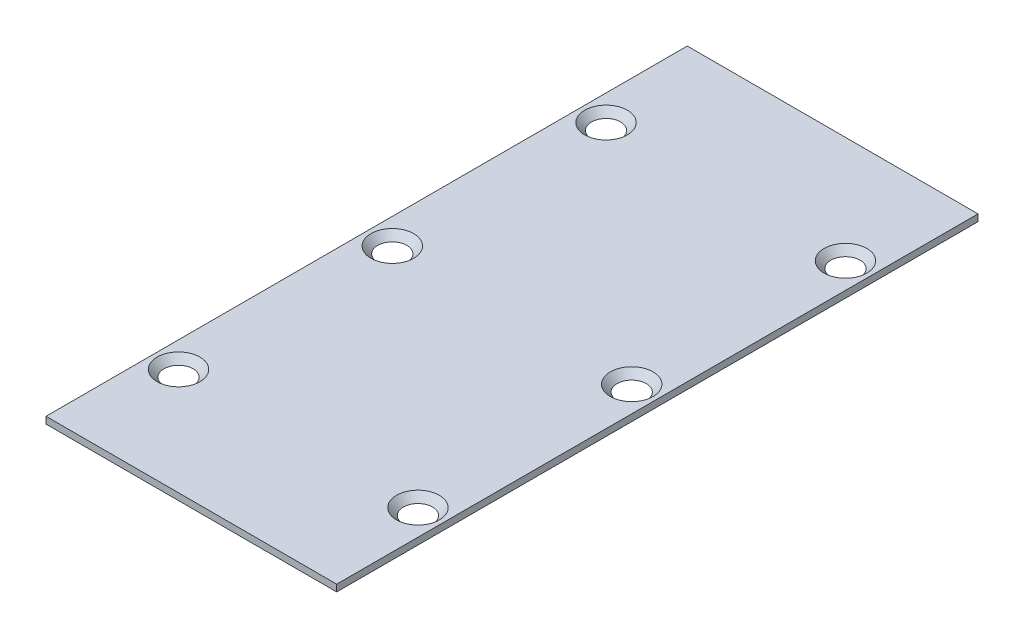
ISO-10303-21;
HEADER;
FILE_DESCRIPTION(('STEP AP214'),'2;1');
FILE_NAME('part.step','',(''),(''),'','','');
FILE_SCHEMA(('AUTOMOTIVE_DESIGN { 1 0 10303 214 1 1 1 1 }'));
ENDSEC;
DATA;
#1=APPLICATION_CONTEXT('core data for automotive mechanical design processes');
#2=APPLICATION_PROTOCOL_DEFINITION('international standard','automotive_design',2000,#1);
#3=PRODUCT_CONTEXT('',#1,'mechanical');
#4=PRODUCT('Part','Part','',(#3));
#5=PRODUCT_RELATED_PRODUCT_CATEGORY('part','',(#4));
#6=PRODUCT_DEFINITION_FORMATION('','',#4);
#7=PRODUCT_DEFINITION_CONTEXT('part definition',#1,'design');
#8=PRODUCT_DEFINITION('design','',#6,#7);
#9=PRODUCT_DEFINITION_SHAPE('','',#8);
#10=(LENGTH_UNIT() NAMED_UNIT(*) SI_UNIT(.MILLI.,.METRE.));
#11=(NAMED_UNIT(*) PLANE_ANGLE_UNIT() SI_UNIT($,.RADIAN.));
#12=(NAMED_UNIT(*) SI_UNIT($,.STERADIAN.) SOLID_ANGLE_UNIT());
#13=UNCERTAINTY_MEASURE_WITH_UNIT(LENGTH_MEASURE(1.E-05),#10,'distance_accuracy_value','');
#14=(GEOMETRIC_REPRESENTATION_CONTEXT(3) GLOBAL_UNCERTAINTY_ASSIGNED_CONTEXT((#13)) GLOBAL_UNIT_ASSIGNED_CONTEXT((#10,
#11,#12)) REPRESENTATION_CONTEXT('',''));
#15=CARTESIAN_POINT('',(0.,0.,0.));
#16=DIRECTION('',(0.,0.,1.));
#17=DIRECTION('',(1.,0.,0.));
#18=AXIS2_PLACEMENT_3D('',#15,#16,#17);
#19=CARTESIAN_POINT('',(0.,0.793749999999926,0.));
#20=DIRECTION('',(0.,1.,0.));
#21=DIRECTION('',(0.,0.,1.));
#22=AXIS2_PLACEMENT_3D('',#19,#20,#21);
#23=PLANE('',#22);
#24=DIRECTION('',(0.,0.,1.));
#25=VECTOR('',#24,1.);
#26=CARTESIAN_POINT('',(34.,0.793749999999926,-75.));
#27=LINE('',#26,#25);
#28=CARTESIAN_POINT('',(34.,0.793749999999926,75.));
#29=VERTEX_POINT('',#28);
#30=CARTESIAN_POINT('',(34.,0.793749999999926,-75.));
#31=VERTEX_POINT('',#30);
#32=EDGE_CURVE('E56',#29,#31,#27,.F.);
#33=ORIENTED_EDGE('',*,*,#32,.T.);
#34=DIRECTION('',(1.,0.,0.));
#35=VECTOR('',#34,1.);
#36=CARTESIAN_POINT('',(-34.,0.793749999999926,-75.));
#37=LINE('',#36,#35);
#38=CARTESIAN_POINT('',(-34.,0.793749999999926,-75.));
#39=VERTEX_POINT('',#38);
#40=EDGE_CURVE('E254',#31,#39,#37,.F.);
#41=ORIENTED_EDGE('',*,*,#40,.T.);
#42=DIRECTION('',(0.,0.,-1.));
#43=VECTOR('',#42,1.);
#44=CARTESIAN_POINT('',(-34.,0.793749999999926,-75.));
#45=LINE('',#44,#43);
#46=CARTESIAN_POINT('',(-34.,0.793749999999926,75.));
#47=VERTEX_POINT('',#46);
#48=EDGE_CURVE('E61',#39,#47,#45,.F.);
#49=ORIENTED_EDGE('',*,*,#48,.T.);
#50=DIRECTION('',(-1.,0.,0.));
#51=VECTOR('',#50,1.);
#52=CARTESIAN_POINT('',(-34.,0.793749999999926,75.));
#53=LINE('',#52,#51);
#54=EDGE_CURVE('E59',#47,#29,#53,.F.);
#55=ORIENTED_EDGE('',*,*,#54,.T.);
#56=EDGE_LOOP('',(#33,#41,#49,#55));
#57=FACE_BOUND('',#56,.T.);
#58=CARTESIAN_POINT('',(28.,0.793750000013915,50.));
#59=DIRECTION('',(0.,1.,0.));
#60=DIRECTION('',(0.,0.,1.));
#61=AXIS2_PLACEMENT_3D('',#58,#59,#60);
#62=CIRCLE('',#61,4.99999999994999);
#63=CARTESIAN_POINT('',(28.,0.793750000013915,54.99999999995));
#64=VERTEX_POINT('',#63);
#65=EDGE_CURVE('E103',#64,#64,#62,.F.);
#66=ORIENTED_EDGE('',*,*,#65,.T.);
#67=EDGE_LOOP('',(#66));
#68=FACE_BOUND('',#67,.T.);
#69=CARTESIAN_POINT('',(28.,0.793750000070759,-50.));
#70=DIRECTION('',(0.,1.,0.));
#71=DIRECTION('',(-1.,0.,0.));
#72=AXIS2_PLACEMENT_3D('',#69,#70,#71);
#73=CIRCLE('',#72,4.99999999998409);
#74=CARTESIAN_POINT('',(23.0000000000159,0.793750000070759,-50.));
#75=VERTEX_POINT('',#74);
#76=EDGE_CURVE('E67',#75,#75,#73,.F.);
#77=ORIENTED_EDGE('',*,*,#76,.T.);
#78=EDGE_LOOP('',(#77));
#79=FACE_BOUND('',#78,.T.);
#80=CARTESIAN_POINT('',(28.,0.793750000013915,0.));
#81=DIRECTION('',(0.,1.,0.));
#82=DIRECTION('',(0.,0.,1.));
#83=AXIS2_PLACEMENT_3D('',#80,#81,#82);
#84=CIRCLE('',#83,4.99999999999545);
#85=CARTESIAN_POINT('',(28.,0.793750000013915,4.99999999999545));
#86=VERTEX_POINT('',#85);
#87=EDGE_CURVE('E100',#86,#86,#84,.F.);
#88=ORIENTED_EDGE('',*,*,#87,.T.);
#89=EDGE_LOOP('',(#88));
#90=FACE_BOUND('',#89,.T.);
#91=CARTESIAN_POINT('',(-28.,0.793750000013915,50.));
#92=DIRECTION('',(0.,1.,0.));
#93=DIRECTION('',(-1.,0.,0.));
#94=AXIS2_PLACEMENT_3D('',#91,#92,#93);
#95=CIRCLE('',#94,4.99999999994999);
#96=CARTESIAN_POINT('',(-32.99999999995,0.793750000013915,50.));
#97=VERTEX_POINT('',#96);
#98=EDGE_CURVE('E108',#97,#97,#95,.F.);
#99=ORIENTED_EDGE('',*,*,#98,.T.);
#100=EDGE_LOOP('',(#99));
#101=FACE_BOUND('',#100,.T.);
#102=CARTESIAN_POINT('',(-28.,0.793749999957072,-50.));
#103=DIRECTION('',(0.,1.,0.));
#104=DIRECTION('',(-1.,0.,0.));
#105=AXIS2_PLACEMENT_3D('',#102,#103,#104);
#106=CIRCLE('',#105,4.99999999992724);
#107=CARTESIAN_POINT('',(-32.9999999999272,0.793749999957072,-50.));
#108=VERTEX_POINT('',#107);
#109=EDGE_CURVE('E97',#108,#108,#106,.F.);
#110=ORIENTED_EDGE('',*,*,#109,.T.);
#111=EDGE_LOOP('',(#110));
#112=FACE_BOUND('',#111,.T.);
#113=CARTESIAN_POINT('',(-28.,0.793750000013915,0.));
#114=DIRECTION('',(0.,1.,0.));
#115=DIRECTION('',(0.,0.,1.));
#116=AXIS2_PLACEMENT_3D('',#113,#114,#115);
#117=CIRCLE('',#116,4.99999999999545);
#118=CARTESIAN_POINT('',(-28.,0.793750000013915,4.99999999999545));
#119=VERTEX_POINT('',#118);
#120=EDGE_CURVE('E20',#119,#119,#117,.F.);
#121=ORIENTED_EDGE('',*,*,#120,.T.);
#122=EDGE_LOOP('',(#121));
#123=FACE_BOUND('',#122,.T.);
#124=ADVANCED_FACE('F17',(#57,#68,#79,#90,#101,#112,#123),#23,.T.);
#125=CARTESIAN_POINT('',(-28.,0.793750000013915,0.));
#126=DIRECTION('',(0.,1.,0.));
#127=DIRECTION('',(0.,0.,1.));
#128=AXIS2_PLACEMENT_3D('',#125,#126,#127);
#129=CONICAL_SURFACE('',#128,4.99999999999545,0.785398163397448);
#130=CARTESIAN_POINT('',(-28.,-0.793749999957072,0.));
#131=DIRECTION('',(0.,1.,0.));
#132=DIRECTION('',(0.,0.,1.));
#133=AXIS2_PLACEMENT_3D('',#130,#131,#132);
#134=CIRCLE('',#133,3.41250000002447);
#135=CARTESIAN_POINT('',(-28.,-0.793749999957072,3.41250000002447));
#136=VERTEX_POINT('',#135);
#137=EDGE_CURVE('E94',#136,#136,#134,.F.);
#138=ORIENTED_EDGE('',*,*,#137,.T.);
#139=EDGE_LOOP('',(#138));
#140=FACE_BOUND('',#139,.T.);
#141=ORIENTED_EDGE('',*,*,#120,.F.);
#142=EDGE_LOOP('',(#141));
#143=FACE_BOUND('',#142,.T.);
#144=ADVANCED_FACE('F116',(#140,#143),#129,.F.);
#145=CARTESIAN_POINT('',(-28.,0.793749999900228,50.));
#146=DIRECTION('',(0.,1.,0.));
#147=DIRECTION('',(-1.,0.,0.));
#148=AXIS2_PLACEMENT_3D('',#145,#146,#147);
#149=CONICAL_SURFACE('',#148,4.9999999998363,0.785398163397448);
#150=CARTESIAN_POINT('',(-28.,-0.793749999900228,50.));
#151=DIRECTION('',(0.,1.,0.));
#152=DIRECTION('',(-1.,0.,0.));
#153=AXIS2_PLACEMENT_3D('',#150,#151,#152);
#154=CIRCLE('',#153,3.41250000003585);
#155=CARTESIAN_POINT('',(-31.4125000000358,-0.793749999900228,50.));
#156=VERTEX_POINT('',#155);
#157=EDGE_CURVE('E91',#156,#156,#154,.F.);
#158=ORIENTED_EDGE('',*,*,#157,.T.);
#159=EDGE_LOOP('',(#158));
#160=FACE_BOUND('',#159,.T.);
#161=ORIENTED_EDGE('',*,*,#98,.F.);
#162=EDGE_LOOP('',(#161));
#163=FACE_BOUND('',#162,.T.);
#164=ADVANCED_FACE('F118',(#160,#163),#149,.F.);
#165=CARTESIAN_POINT('',(28.,0.793750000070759,-50.));
#166=DIRECTION('',(0.,1.,0.));
#167=DIRECTION('',(-1.,0.,0.));
#168=AXIS2_PLACEMENT_3D('',#165,#166,#167);
#169=CONICAL_SURFACE('',#168,4.99999999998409,0.785398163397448);
#170=CARTESIAN_POINT('',(28.,-0.793749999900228,-50.));
#171=DIRECTION('',(0.,1.,0.));
#172=DIRECTION('',(-1.,0.,0.));
#173=AXIS2_PLACEMENT_3D('',#170,#171,#172);
#174=CIRCLE('',#173,3.41250000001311);
#175=CARTESIAN_POINT('',(24.5874999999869,-0.793749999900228,-50.));
#176=VERTEX_POINT('',#175);
#177=EDGE_CURVE('E88',#176,#176,#174,.F.);
#178=ORIENTED_EDGE('',*,*,#177,.T.);
#179=EDGE_LOOP('',(#178));
#180=FACE_BOUND('',#179,.T.);
#181=ORIENTED_EDGE('',*,*,#76,.F.);
#182=EDGE_LOOP('',(#181));
#183=FACE_BOUND('',#182,.T.);
#184=ADVANCED_FACE('F125',(#180,#183),#169,.F.);
#185=CARTESIAN_POINT('',(-34.,0.793749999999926,75.));
#186=DIRECTION('',(0.,0.,-1.));
#187=DIRECTION('',(-1.,0.,0.));
#188=AXIS2_PLACEMENT_3D('',#185,#186,#187);
#189=PLANE('',#188);
#190=DIRECTION('',(0.,1.,0.));
#191=VECTOR('',#190,1.);
#192=CARTESIAN_POINT('',(34.,0.793749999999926,75.));
#193=LINE('',#192,#191);
#194=CARTESIAN_POINT('',(34.,-0.793749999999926,75.));
#195=VERTEX_POINT('',#194);
#196=EDGE_CURVE('E66',#195,#29,#193,.T.);
#197=ORIENTED_EDGE('',*,*,#196,.T.);
#198=ORIENTED_EDGE('',*,*,#54,.F.);
#199=DIRECTION('',(0.,1.,0.));
#200=VECTOR('',#199,1.);
#201=CARTESIAN_POINT('',(-34.,0.793749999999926,75.));
#202=LINE('',#201,#200);
#203=CARTESIAN_POINT('',(-34.,-0.793749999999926,75.));
#204=VERTEX_POINT('',#203);
#205=EDGE_CURVE('E106',#47,#204,#202,.F.);
#206=ORIENTED_EDGE('',*,*,#205,.T.);
#207=DIRECTION('',(1.,0.,0.));
#208=VECTOR('',#207,1.);
#209=CARTESIAN_POINT('',(0.,-0.793749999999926,75.));
#210=LINE('',#209,#208);
#211=EDGE_CURVE('E78',#204,#195,#210,.T.);
#212=ORIENTED_EDGE('',*,*,#211,.T.);
#213=EDGE_LOOP('',(#197,#198,#206,#212));
#214=FACE_BOUND('',#213,.T.);
#215=ADVANCED_FACE('F77',(#214),#189,.F.);
#216=CARTESIAN_POINT('',(34.,0.793749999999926,-75.));
#217=DIRECTION('',(-1.,0.,0.));
#218=DIRECTION('',(0.,0.,1.));
#219=AXIS2_PLACEMENT_3D('',#216,#217,#218);
#220=PLANE('',#219);
#221=DIRECTION('',(0.,1.,0.));
#222=VECTOR('',#221,1.);
#223=CARTESIAN_POINT('',(34.,0.793749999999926,-75.));
#224=LINE('',#223,#222);
#225=CARTESIAN_POINT('',(34.,-0.793749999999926,-75.));
#226=VERTEX_POINT('',#225);
#227=EDGE_CURVE('E74',#226,#31,#224,.T.);
#228=ORIENTED_EDGE('',*,*,#227,.T.);
#229=ORIENTED_EDGE('',*,*,#32,.F.);
#230=ORIENTED_EDGE('',*,*,#196,.F.);
#231=DIRECTION('',(0.,0.,1.));
#232=VECTOR('',#231,1.);
#233=CARTESIAN_POINT('',(34.,-0.793749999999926,0.));
#234=LINE('',#233,#232);
#235=EDGE_CURVE('E263',#195,#226,#234,.F.);
#236=ORIENTED_EDGE('',*,*,#235,.T.);
#237=EDGE_LOOP('',(#228,#229,#230,#236));
#238=FACE_BOUND('',#237,.T.);
#239=ADVANCED_FACE('F71',(#238),#220,.F.);
#240=CARTESIAN_POINT('',(-34.,0.793749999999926,-75.));
#241=DIRECTION('',(0.,0.,1.));
#242=DIRECTION('',(1.,0.,0.));
#243=AXIS2_PLACEMENT_3D('',#240,#241,#242);
#244=PLANE('',#243);
#245=DIRECTION('',(0.,1.,0.));
#246=VECTOR('',#245,1.);
#247=CARTESIAN_POINT('',(-34.,0.793749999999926,-75.));
#248=LINE('',#247,#246);
#249=CARTESIAN_POINT('',(-34.,-0.793749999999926,-75.));
#250=VERTEX_POINT('',#249);
#251=EDGE_CURVE('E35',#250,#39,#248,.T.);
#252=ORIENTED_EDGE('',*,*,#251,.T.);
#253=ORIENTED_EDGE('',*,*,#40,.F.);
#254=ORIENTED_EDGE('',*,*,#227,.F.);
#255=DIRECTION('',(1.,0.,0.));
#256=VECTOR('',#255,1.);
#257=CARTESIAN_POINT('',(0.,-0.793749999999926,-75.));
#258=LINE('',#257,#256);
#259=EDGE_CURVE('E256',#226,#250,#258,.F.);
#260=ORIENTED_EDGE('',*,*,#259,.T.);
#261=EDGE_LOOP('',(#252,#253,#254,#260));
#262=FACE_BOUND('',#261,.T.);
#263=ADVANCED_FACE('F152',(#262),#244,.F.);
#264=CARTESIAN_POINT('',(-34.,0.793749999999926,-75.));
#265=DIRECTION('',(1.,0.,0.));
#266=DIRECTION('',(0.,0.,-1.));
#267=AXIS2_PLACEMENT_3D('',#264,#265,#266);
#268=PLANE('',#267);
#269=ORIENTED_EDGE('',*,*,#205,.F.);
#270=ORIENTED_EDGE('',*,*,#48,.F.);
#271=ORIENTED_EDGE('',*,*,#251,.F.);
#272=DIRECTION('',(0.,0.,1.));
#273=VECTOR('',#272,1.);
#274=CARTESIAN_POINT('',(-34.,-0.793749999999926,0.));
#275=LINE('',#274,#273);
#276=EDGE_CURVE('E87',#250,#204,#275,.T.);
#277=ORIENTED_EDGE('',*,*,#276,.T.);
#278=EDGE_LOOP('',(#269,#270,#271,#277));
#279=FACE_BOUND('',#278,.T.);
#280=ADVANCED_FACE('F148',(#279),#268,.F.);
#281=CARTESIAN_POINT('',(28.,0.793749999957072,50.));
#282=DIRECTION('',(0.,1.,0.));
#283=DIRECTION('',(0.,0.,1.));
#284=AXIS2_PLACEMENT_3D('',#281,#282,#283);
#285=CONICAL_SURFACE('',#284,4.99999999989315,0.785398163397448);
#286=CARTESIAN_POINT('',(28.,-0.793749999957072,50.));
#287=DIRECTION('',(0.,1.,0.));
#288=DIRECTION('',(0.,0.,1.));
#289=AXIS2_PLACEMENT_3D('',#286,#287,#288);
#290=CIRCLE('',#289,3.412499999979);
#291=CARTESIAN_POINT('',(28.,-0.793749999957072,53.412499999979));
#292=VERTEX_POINT('',#291);
#293=EDGE_CURVE('E84',#292,#292,#290,.F.);
#294=ORIENTED_EDGE('',*,*,#293,.T.);
#295=EDGE_LOOP('',(#294));
#296=FACE_BOUND('',#295,.T.);
#297=ORIENTED_EDGE('',*,*,#65,.F.);
#298=EDGE_LOOP('',(#297));
#299=FACE_BOUND('',#298,.T.);
#300=ADVANCED_FACE('F144',(#296,#299),#285,.F.);
#301=CARTESIAN_POINT('',(28.,0.793750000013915,0.));
#302=DIRECTION('',(0.,1.,0.));
#303=DIRECTION('',(0.,0.,1.));
#304=AXIS2_PLACEMENT_3D('',#301,#302,#303);
#305=CONICAL_SURFACE('',#304,4.99999999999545,0.785398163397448);
#306=CARTESIAN_POINT('',(28.,-0.793749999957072,0.));
#307=DIRECTION('',(0.,1.,0.));
#308=DIRECTION('',(0.,0.,1.));
#309=AXIS2_PLACEMENT_3D('',#306,#307,#308);
#310=CIRCLE('',#309,3.41250000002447);
#311=CARTESIAN_POINT('',(28.,-0.793749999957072,3.41250000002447));
#312=VERTEX_POINT('',#311);
#313=EDGE_CURVE('E26',#312,#312,#310,.F.);
#314=ORIENTED_EDGE('',*,*,#313,.T.);
#315=EDGE_LOOP('',(#314));
#316=FACE_BOUND('',#315,.T.);
#317=ORIENTED_EDGE('',*,*,#87,.F.);
#318=EDGE_LOOP('',(#317));
#319=FACE_BOUND('',#318,.T.);
#320=ADVANCED_FACE('F136',(#316,#319),#305,.F.);
#321=CARTESIAN_POINT('',(-28.,0.793749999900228,-50.));
#322=DIRECTION('',(0.,1.,0.));
#323=DIRECTION('',(-1.,0.,0.));
#324=AXIS2_PLACEMENT_3D('',#321,#322,#323);
#325=CONICAL_SURFACE('',#324,4.9999999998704,0.785398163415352);
#326=CARTESIAN_POINT('',(-28.,-0.793749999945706,-50.));
#327=DIRECTION('',(0.,1.,0.));
#328=DIRECTION('',(-1.,0.,0.));
#329=AXIS2_PLACEMENT_3D('',#326,#327,#328);
#330=CIRCLE('',#329,3.41249999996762);
#331=CARTESIAN_POINT('',(-31.4124999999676,-0.793749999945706,-50.));
#332=VERTEX_POINT('',#331);
#333=EDGE_CURVE('E11',#332,#332,#330,.F.);
#334=ORIENTED_EDGE('',*,*,#333,.T.);
#335=EDGE_LOOP('',(#334));
#336=FACE_BOUND('',#335,.T.);
#337=ORIENTED_EDGE('',*,*,#109,.F.);
#338=EDGE_LOOP('',(#337));
#339=FACE_BOUND('',#338,.T.);
#340=ADVANCED_FACE('F130',(#336,#339),#325,.F.);
#341=CARTESIAN_POINT('',(0.,-0.793749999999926,0.));
#342=DIRECTION('',(0.,1.,0.));
#343=DIRECTION('',(0.,0.,1.));
#344=AXIS2_PLACEMENT_3D('',#341,#342,#343);
#345=PLANE('',#344);
#346=ORIENTED_EDGE('',*,*,#333,.F.);
#347=EDGE_LOOP('',(#346));
#348=FACE_BOUND('',#347,.T.);
#349=ORIENTED_EDGE('',*,*,#313,.F.);
#350=EDGE_LOOP('',(#349));
#351=FACE_BOUND('',#350,.T.);
#352=ORIENTED_EDGE('',*,*,#293,.F.);
#353=EDGE_LOOP('',(#352));
#354=FACE_BOUND('',#353,.T.);
#355=ORIENTED_EDGE('',*,*,#259,.F.);
#356=ORIENTED_EDGE('',*,*,#235,.F.);
#357=ORIENTED_EDGE('',*,*,#211,.F.);
#358=ORIENTED_EDGE('',*,*,#276,.F.);
#359=EDGE_LOOP('',(#355,#356,#357,#358));
#360=FACE_BOUND('',#359,.T.);
#361=ORIENTED_EDGE('',*,*,#177,.F.);
#362=EDGE_LOOP('',(#361));
#363=FACE_BOUND('',#362,.T.);
#364=ORIENTED_EDGE('',*,*,#157,.F.);
#365=EDGE_LOOP('',(#364));
#366=FACE_BOUND('',#365,.T.);
#367=ORIENTED_EDGE('',*,*,#137,.F.);
#368=EDGE_LOOP('',(#367));
#369=FACE_BOUND('',#368,.T.);
#370=ADVANCED_FACE('F128',(#348,#351,#354,#360,#363,#366,#369),#345,.F.);
#371=CLOSED_SHELL('',(#124,#144,#164,#184,#215,#239,#263,#280,#300,#320,#340,#370));
#372=MANIFOLD_SOLID_BREP('B1',#371);
#373=ADVANCED_BREP_SHAPE_REPRESENTATION('',(#18,#372),#14);
#374=SHAPE_DEFINITION_REPRESENTATION(#9,#373);
ENDSEC;
END-ISO-10303-21;
